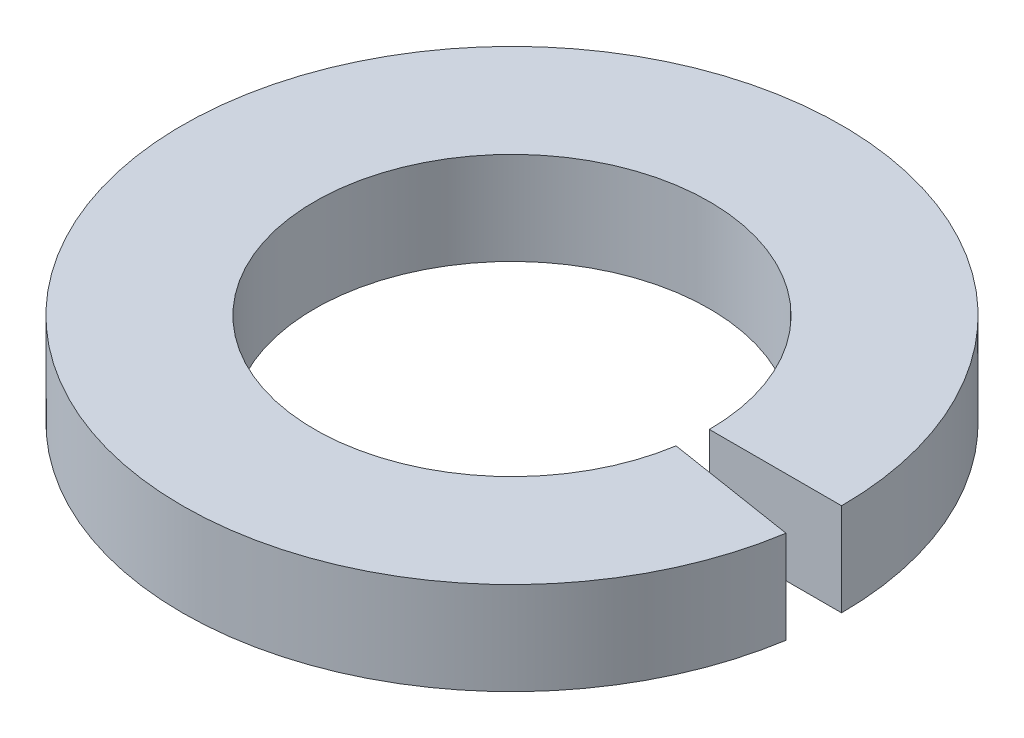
ISO-10303-21;
HEADER;
FILE_DESCRIPTION(('STEP AP214'),'2;1');
FILE_NAME('part.step','',(''),(''),'','','');
FILE_SCHEMA(('AUTOMOTIVE_DESIGN { 1 0 10303 214 1 1 1 1 }'));
ENDSEC;
DATA;
#1=APPLICATION_CONTEXT('core data for automotive mechanical design processes');
#2=APPLICATION_PROTOCOL_DEFINITION('international standard','automotive_design',2000,#1);
#3=PRODUCT_CONTEXT('',#1,'mechanical');
#4=PRODUCT('Part','Part','',(#3));
#5=PRODUCT_RELATED_PRODUCT_CATEGORY('part','',(#4));
#6=PRODUCT_DEFINITION_FORMATION('','',#4);
#7=PRODUCT_DEFINITION_CONTEXT('part definition',#1,'design');
#8=PRODUCT_DEFINITION('design','',#6,#7);
#9=PRODUCT_DEFINITION_SHAPE('','',#8);
#10=(LENGTH_UNIT() NAMED_UNIT(*) SI_UNIT(.MILLI.,.METRE.));
#11=(NAMED_UNIT(*) PLANE_ANGLE_UNIT() SI_UNIT($,.RADIAN.));
#12=(NAMED_UNIT(*) SI_UNIT($,.STERADIAN.) SOLID_ANGLE_UNIT());
#13=UNCERTAINTY_MEASURE_WITH_UNIT(LENGTH_MEASURE(1.E-05),#10,'distance_accuracy_value','');
#14=(GEOMETRIC_REPRESENTATION_CONTEXT(3) GLOBAL_UNCERTAINTY_ASSIGNED_CONTEXT((#13)) GLOBAL_UNIT_ASSIGNED_CONTEXT((#10,
#11,#12)) REPRESENTATION_CONTEXT('',''));
#15=CARTESIAN_POINT('',(0.,0.,0.));
#16=DIRECTION('',(0.,0.,1.));
#17=DIRECTION('',(1.,0.,0.));
#18=AXIS2_PLACEMENT_3D('',#15,#16,#17);
#19=CARTESIAN_POINT('',(4.18957640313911,1.55431223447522E-12,0.663563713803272));
#20=DIRECTION('',(0.,-1.00000000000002,0.));
#21=DIRECTION('',(0.,0.,-1.00000000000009));
#22=AXIS2_PLACEMENT_3D('',#19,#20,#21);
#23=PLANE('',#22);
#24=CARTESIAN_POINT('',(2.27942664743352E-12,3.33066907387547E-13,-4.38711567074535E-12));
#25=DIRECTION('',(0.,-1.00000000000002,0.));
#26=DIRECTION('',(0.,0.,-1.00000000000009));
#27=AXIS2_PLACEMENT_3D('',#24,#25,#26);
#28=CIRCLE('',#27,2.54);
#29=CARTESIAN_POINT('',(2.50872838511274,1.33226762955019E-12,0.397343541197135));
#30=VERTEX_POINT('',#29);
#31=CARTESIAN_POINT('',(2.53999999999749,1.11022302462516E-12,-2.16493489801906E-12));
#32=VERTEX_POINT('',#31);
#33=EDGE_CURVE('E11',#30,#32,#28,.T.);
#34=ORIENTED_EDGE('',*,*,#33,.F.);
#35=DIRECTION('',(0.987688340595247,0.,0.156434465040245));
#36=VECTOR('',#35,1.);
#37=CARTESIAN_POINT('',(4.18957640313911,1.55431223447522E-12,0.663563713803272));
#38=LINE('',#37,#36);
#39=CARTESIAN_POINT('',(4.18957640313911,1.55431223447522E-12,0.663563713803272));
#40=VERTEX_POINT('',#39);
#41=EDGE_CURVE('E73',#30,#40,#38,.T.);
#42=ORIENTED_EDGE('',*,*,#41,.T.);
#43=CARTESIAN_POINT('',(2.27942664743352E-12,3.33066907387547E-13,-4.38711567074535E-12));
#44=DIRECTION('',(0.,-1.00000000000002,0.));
#45=DIRECTION('',(0.,0.,-1.00000000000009));
#46=AXIS2_PLACEMENT_3D('',#43,#44,#45);
#47=CIRCLE('',#46,4.2418);
#48=CARTESIAN_POINT('',(4.24179999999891,1.33226762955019E-12,-8.04911692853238E-12));
#49=VERTEX_POINT('',#48);
#50=EDGE_CURVE('E68',#40,#49,#47,.T.);
#51=ORIENTED_EDGE('',*,*,#50,.T.);
#52=DIRECTION('',(1.00000000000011,0.,0.));
#53=VECTOR('',#52,1.);
#54=CARTESIAN_POINT('',(4.24179999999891,1.33226762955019E-12,-8.04911692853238E-12));
#55=LINE('',#54,#53);
#56=EDGE_CURVE('E71',#32,#49,#55,.T.);
#57=ORIENTED_EDGE('',*,*,#56,.F.);
#58=EDGE_LOOP('',(#34,#42,#51,#57));
#59=FACE_BOUND('',#58,.T.);
#60=ADVANCED_FACE('F32',(#59),#23,.T.);
#61=CARTESIAN_POINT('',(-4.27435864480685E-12,-59.6900000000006,-6.41153796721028E-12));
#62=DIRECTION('',(0.,-1.00000000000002,0.));
#63=DIRECTION('',(0.,0.,-1.00000000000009));
#64=AXIS2_PLACEMENT_3D('',#61,#62,#63);
#65=CYLINDRICAL_SURFACE('',#64,2.54);
#66=CARTESIAN_POINT('',(5.71764857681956E-12,1.19380000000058,-3.21964677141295E-12));
#67=DIRECTION('',(0.,-1.00000000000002,0.));
#68=DIRECTION('',(0.,0.,-1.00000000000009));
#69=AXIS2_PLACEMENT_3D('',#66,#67,#68);
#70=CIRCLE('',#69,2.54);
#71=CARTESIAN_POINT('',(2.50872838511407,1.19380000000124,0.397343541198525));
#72=VERTEX_POINT('',#71);
#73=CARTESIAN_POINT('',(2.53999999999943,1.19380000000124,-5.27529409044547E-12));
#74=VERTEX_POINT('',#73);
#75=EDGE_CURVE('E40',#72,#74,#70,.T.);
#76=ORIENTED_EDGE('',*,*,#75,.F.);
#77=DIRECTION('',(0.,-1.00000000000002,0.));
#78=VECTOR('',#77,1.);
#79=CARTESIAN_POINT('',(2.50872838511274,1.33226762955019E-12,0.397343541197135));
#80=LINE('',#79,#78);
#81=EDGE_CURVE('E78',#72,#30,#80,.T.);
#82=ORIENTED_EDGE('',*,*,#81,.T.);
#83=ORIENTED_EDGE('',*,*,#33,.T.);
#84=DIRECTION('',(0.,-1.00000000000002,0.));
#85=VECTOR('',#84,1.);
#86=CARTESIAN_POINT('',(2.53999999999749,1.11022302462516E-12,-2.16493489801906E-12));
#87=LINE('',#86,#85);
#88=EDGE_CURVE('E90',#74,#32,#87,.T.);
#89=ORIENTED_EDGE('',*,*,#88,.F.);
#90=EDGE_LOOP('',(#76,#82,#83,#89));
#91=FACE_BOUND('',#90,.T.);
#92=ADVANCED_FACE('F34',(#91),#65,.F.);
#93=CARTESIAN_POINT('',(2.50872838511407,1.19380000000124,0.397343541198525));
#94=DIRECTION('',(0.,1.00000000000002,0.));
#95=DIRECTION('',(0.,0.,1.00000000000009));
#96=AXIS2_PLACEMENT_3D('',#93,#94,#95);
#97=PLANE('',#96);
#98=CARTESIAN_POINT('',(5.71764857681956E-12,1.19380000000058,-3.21964677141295E-12));
#99=DIRECTION('',(0.,-1.00000000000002,0.));
#100=DIRECTION('',(0.,0.,-1.00000000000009));
#101=AXIS2_PLACEMENT_3D('',#98,#99,#100);
#102=CIRCLE('',#101,4.2418);
#103=CARTESIAN_POINT('',(4.18957640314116,1.19380000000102,0.663563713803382));
#104=VERTEX_POINT('',#103);
#105=CARTESIAN_POINT('',(4.24180000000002,1.19380000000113,-9.71445146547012E-12));
#106=VERTEX_POINT('',#105);
#107=EDGE_CURVE('E77',#104,#106,#102,.T.);
#108=ORIENTED_EDGE('',*,*,#107,.F.);
#109=DIRECTION('',(-0.987688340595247,0.,-0.156434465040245));
#110=VECTOR('',#109,1.);
#111=CARTESIAN_POINT('',(2.50872838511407,1.19380000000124,0.397343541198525));
#112=LINE('',#111,#110);
#113=EDGE_CURVE('E98',#104,#72,#112,.T.);
#114=ORIENTED_EDGE('',*,*,#113,.T.);
#115=ORIENTED_EDGE('',*,*,#75,.T.);
#116=DIRECTION('',(-1.00000000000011,0.,0.));
#117=VECTOR('',#116,1.);
#118=CARTESIAN_POINT('',(2.53999999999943,1.19380000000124,-5.27529409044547E-12));
#119=LINE('',#118,#117);
#120=EDGE_CURVE('E86',#106,#74,#119,.T.);
#121=ORIENTED_EDGE('',*,*,#120,.F.);
#122=EDGE_LOOP('',(#108,#114,#115,#121));
#123=FACE_BOUND('',#122,.T.);
#124=ADVANCED_FACE('F102',(#123),#97,.T.);
#125=CARTESIAN_POINT('',(-4.27435864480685E-12,-59.6900000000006,-6.41153796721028E-12));
#126=DIRECTION('',(0.,-1.00000000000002,0.));
#127=DIRECTION('',(0.,0.,-1.00000000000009));
#128=AXIS2_PLACEMENT_3D('',#125,#126,#127);
#129=CYLINDRICAL_SURFACE('',#128,4.2418);
#130=DIRECTION('',(0.,1.00000000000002,0.));
#131=VECTOR('',#130,1.);
#132=CARTESIAN_POINT('',(4.18957640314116,1.19380000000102,0.663563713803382));
#133=LINE('',#132,#131);
#134=EDGE_CURVE('E96',#40,#104,#133,.T.);
#135=ORIENTED_EDGE('',*,*,#134,.T.);
#136=ORIENTED_EDGE('',*,*,#107,.T.);
#137=DIRECTION('',(0.,1.00000000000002,0.));
#138=VECTOR('',#137,1.);
#139=CARTESIAN_POINT('',(4.24180000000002,1.19380000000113,-9.71445146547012E-12));
#140=LINE('',#139,#138);
#141=EDGE_CURVE('E81',#49,#106,#140,.T.);
#142=ORIENTED_EDGE('',*,*,#141,.F.);
#143=ORIENTED_EDGE('',*,*,#50,.F.);
#144=EDGE_LOOP('',(#135,#136,#142,#143));
#145=FACE_BOUND('',#144,.T.);
#146=ADVANCED_FACE('F82',(#145),#129,.T.);
#147=CARTESIAN_POINT('',(2.50872838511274,1.33226762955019E-12,0.397343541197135));
#148=DIRECTION('',(0.156434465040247,0.,-0.987688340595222));
#149=DIRECTION('',(-0.987688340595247,0.,-0.156434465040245));
#150=AXIS2_PLACEMENT_3D('',#147,#148,#149);
#151=PLANE('',#150);
#152=ORIENTED_EDGE('',*,*,#41,.F.);
#153=ORIENTED_EDGE('',*,*,#81,.F.);
#154=ORIENTED_EDGE('',*,*,#113,.F.);
#155=ORIENTED_EDGE('',*,*,#134,.F.);
#156=EDGE_LOOP('',(#152,#153,#154,#155));
#157=FACE_BOUND('',#156,.T.);
#158=ADVANCED_FACE('F106',(#157),#151,.T.);
#159=CARTESIAN_POINT('',(2.53999999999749,1.11022302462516E-12,-2.16493489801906E-12));
#160=DIRECTION('',(0.,0.,-1.00000000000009));
#161=DIRECTION('',(-1.00000000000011,0.,0.));
#162=AXIS2_PLACEMENT_3D('',#159,#160,#161);
#163=PLANE('',#162);
#164=ORIENTED_EDGE('',*,*,#56,.T.);
#165=ORIENTED_EDGE('',*,*,#141,.T.);
#166=ORIENTED_EDGE('',*,*,#120,.T.);
#167=ORIENTED_EDGE('',*,*,#88,.T.);
#168=EDGE_LOOP('',(#164,#165,#166,#167));
#169=FACE_BOUND('',#168,.T.);
#170=ADVANCED_FACE('F89',(#169),#163,.F.);
#171=CLOSED_SHELL('',(#60,#92,#124,#146,#158,#170));
#172=MANIFOLD_SOLID_BREP('B2',#171);
#173=ADVANCED_BREP_SHAPE_REPRESENTATION('',(#18,#172),#14);
#174=SHAPE_DEFINITION_REPRESENTATION(#9,#173);
ENDSEC;
END-ISO-10303-21;
